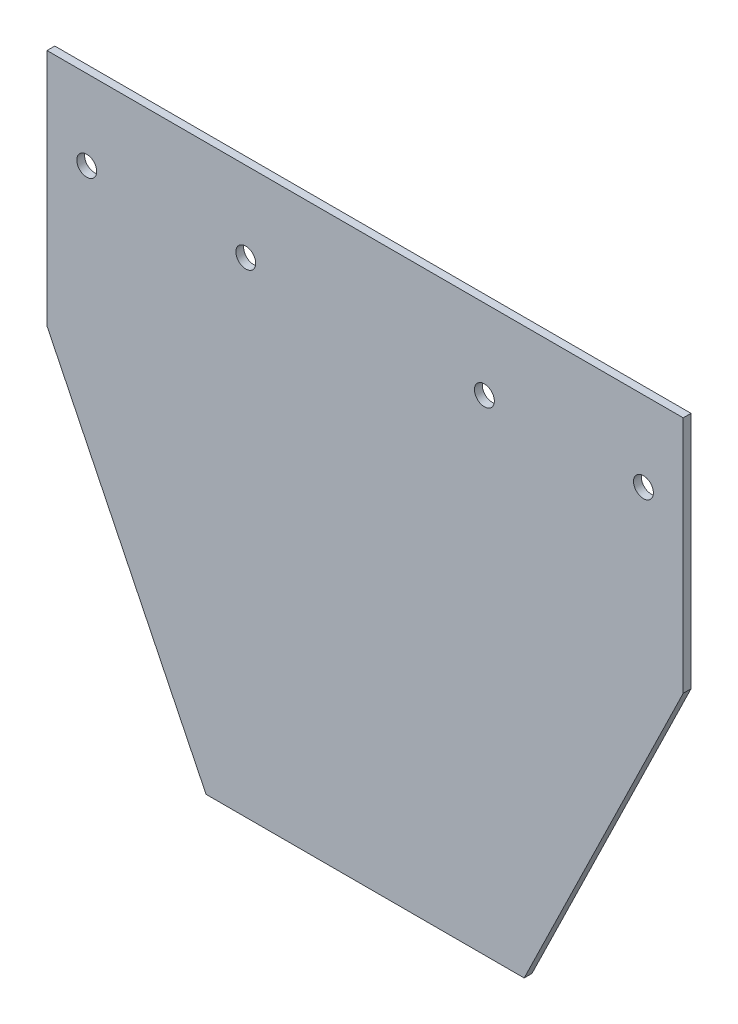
from build123d import *

# Parameters (mm, degrees)
BOSS_EXTRUDE1_DEPTH = 1.2446
SKETCH3_R           = 1.5875
CUT_EXTRUDE1_DEPTH  = 16.2306


with BuildPart() as part:
    # Sketch2 → Boss-Extrude1 (new body)
    with BuildSketch(Plane.XY):
        Polygon((-50.8, -19.05), (-25.4, -71.12), (25.4, -71.12), (50.8, -19.05), (50.8, 19.05), (-50.8, 19.05), align=None)
    extrude(amount=BOSS_EXTRUDE1_DEPTH)

    # Sketch3 → Cut-Extrude1 (cut)
    with BuildSketch(Plane.XY.offset(1.2446)):
        with Locations((-44.45, 6.2875)):
            Circle(SKETCH3_R)
        with Locations((-19.05, 6.2875)):
            Circle(SKETCH3_R)
        with Locations((19.05, 6.2875)):
            Circle(SKETCH3_R)
        with Locations((44.45, 6.2875)):
            Circle(SKETCH3_R)
    extrude(amount=-CUT_EXTRUDE1_DEPTH, mode=Mode.SUBTRACT)


solid = part.part
